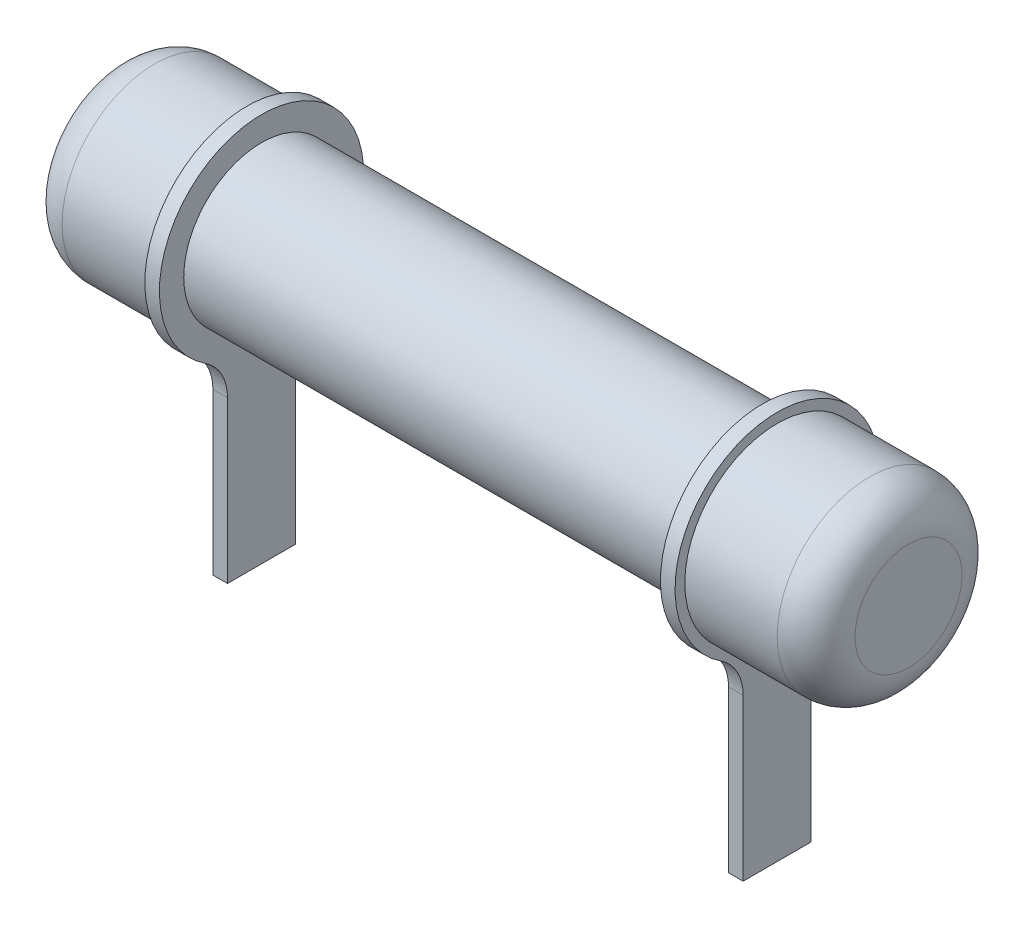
from build123d import *

# Parameters (mm, degrees)
SKETCH_6_W      = 0.3
SKETCH_6_H      = 1.4
EXTRUDE_START   = 7.75
SKETCH_4_R      = 1.6
SKETCH_4_R_2    = 1.3
SKETCH_4_R_3    = 0.15
EXTRUDE_2_DEPTH = 7.75
FILLET_3_R      = 1


with BuildPart() as part:
    # Sketch 2 → Revolve 1 (revolve)
    with BuildSketch(Plane.XY, mode=Mode.PRIVATE) as revolve_1_sk:
        with BuildLine():
            Line((0, 1.6), (0, 2.1))
            Line((0, 2.1), (-0.3, 2.1))
            Line((-0.3, 2.1), (-0.3, 1.9))
            Line((-0.3, 1.9), (-2.2, 1.9))
            ThreePointArc((-2.2, 1.9), (-2.765685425, 1.665685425), (-3, 1.1))
            Line((-3, 1.1), (-3, 0))
            Line((-3, 0), (-2, 0))
            Line((-2, 0), (-2, 1.6))
            Line((-2, 1.6), (0, 1.6))
        make_face()
    revolve_1 = revolve(revolve_1_sk.sketch.rotate(Axis((-3, 0, 0), (1, 0, 0)), 90), axis=Axis((-3, 0, 0), (1, 0, 0)))

    # Sweep 1: sweep along a path in Sketch 7
    with BuildLine(Plane.XY) as sweep_1_path:
        Line((-0.15, -1.9), (-0.15, -5.9))
    # Sketch 6 → Sweep 1 (sweep)
    with BuildSketch(Plane(origin=(0, -1.9, 0), x_dir=(-1, 0, 0), z_dir=(0, 1, 0))):
        with Locations((0.15, 0)):
            Rectangle(SKETCH_6_W, SKETCH_6_H)
    sweep_1 = sweep(path=sweep_1_path.line)

    # Sketch 4 → Extrude 2 (add)
    # profile 1 of 2: a face of its own
    with BuildSketch(Plane(origin=(-2, 0, 0), x_dir=(0, 0, -1), z_dir=(1, 0, 0)).offset(EXTRUDE_START)):
        with Locations(Location((0, 0, 0), (0, 0, 180))):
            Circle(SKETCH_4_R)
        Circle(SKETCH_4_R_2, mode=Mode.SUBTRACT)
    # profile 2 of 2: a face of its own
    with BuildSketch(Plane(origin=(-2, 0, 0), x_dir=(0, 0, -1), z_dir=(1, 0, 0)).offset(EXTRUDE_START)):
        with Locations(Location((0, 0, 0), (0, 0, 180))):
            Circle(SKETCH_4_R_3)
    extrude_2 = extrude(amount=-EXTRUDE_2_DEPTH)

    # Mirror 7: Extrude 2 across plane
    add(extrude_2.mirror(Plane(origin=(5.15, 0, 0), x_dir=(0, 0, 1), z_dir=(1, 0, 0))))

    # Mirror 9: Revolve 1, Sweep 1 across plane
    add(revolve_1.mirror(Plane(origin=(5.15, 0, 0), x_dir=(0, 0, 1), z_dir=(1, 0, 0))))
    add(sweep_1.mirror(Plane(origin=(5.15, 0, 0), x_dir=(0, 0, 1), z_dir=(1, 0, 0))))

    # Fillet 3
    fillet_3_edges = [part.edges().sort_by_distance(p)[0] for p in [
        (-0.15, -1.979898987, 0.7),
        (-0.15, -1.979898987, -0.7),
        (10.45, -1.979898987, -0.7),
        (10.45, -1.979898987, 0.7),
    ]]
    fillet(fillet_3_edges, radius=FILLET_3_R)


solid = part.part
